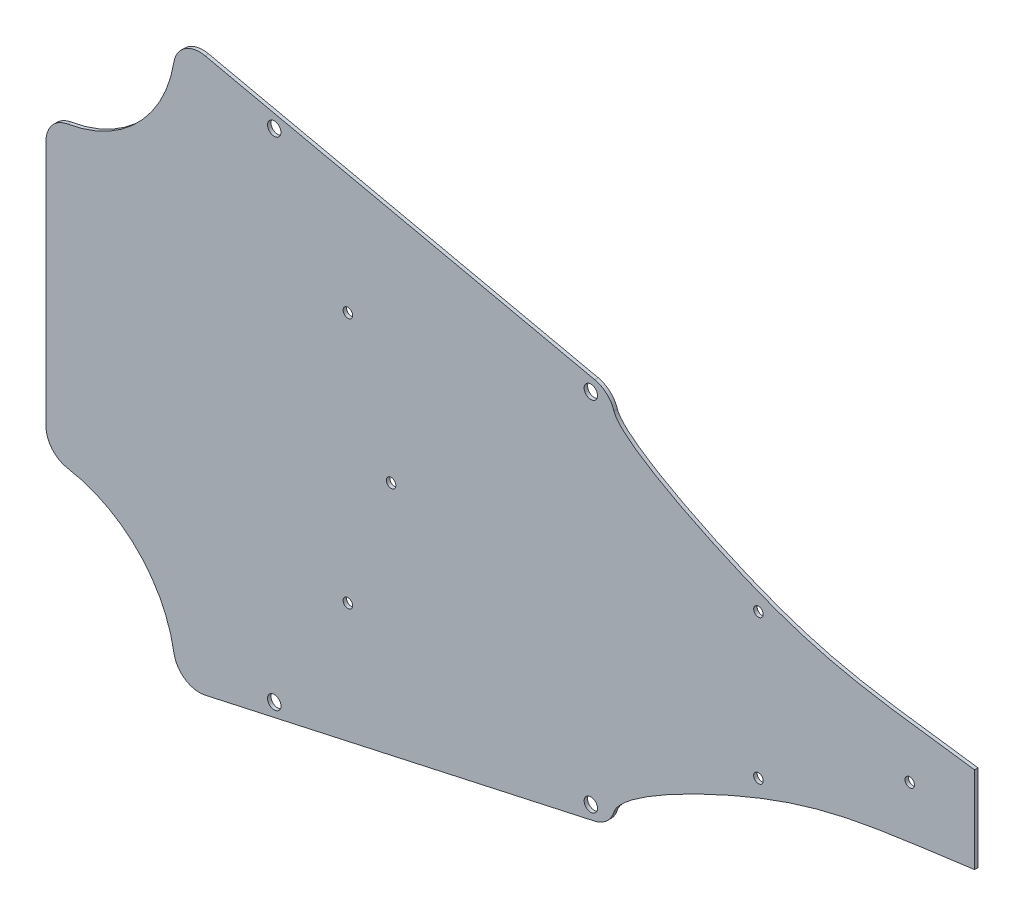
from build123d import *

# Parameters (mm, degrees)
ESQUISSE1_R      = 1.55
ESQUISSE1_R_2    = 1.1
ESQUISSE1_R_3    = 1.549999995
EXTRUSION1_DEPTH = 0.8


with BuildPart() as part:
    # Esquisse1 → Extrusion1 (new body)
    with BuildSketch(Plane.XY):
        with BuildLine():
            Line((25.150523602, 28.5698389), (25.150523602, -28.5698389))
            ThreePointArc((25.150523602, -28.5698389), (26.567947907, -32.442822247), (30.150523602, -34.485918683))
            ThreePointArc((30.150523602, -34.485918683), (46.403818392, -42.893281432), (54.749627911, -59.178268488))
            ThreePointArc((54.749627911, -59.178268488), (57.304746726, -63.16843283), (61.958135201, -64.060631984))
            Line((61.958135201, -64.060631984), (152.131314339, -44.230345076))
            ThreePointArc((152.131314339, -44.230345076), (154.881503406, -42.807429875), (156.555979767, -40.202750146))
            add(Edge.make_bspline(
                [(240, -10), (216.274031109, -13.229517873), (198.784165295, -14.481909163), (158.014867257, -35.653942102), (156.555979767, -40.202750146)],
                knots=[0, 0, 0, 0, 0.573688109, 0.920874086, 0.920874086, 0.920874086, 0.920874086], degree=3))
            Line((240, -10), (240, 10))
            add(Edge.make_bspline(
                [(240, 10), (216.274031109, 13.229517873), (198.784165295, 14.481909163), (158.014867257, 35.653942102), (156.555979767, 40.202750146)],
                knots=[0, 0, 0, 0, 0.573688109, 0.920874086, 0.920874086, 0.920874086, 0.920874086], degree=3))
            ThreePointArc((156.555979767, 40.202750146), (154.881503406, 42.807429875), (152.131314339, 44.230345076))
            Line((152.131314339, 44.230345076), (61.958135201, 64.060631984))
            ThreePointArc((61.958135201, 64.060631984), (57.304746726, 63.16843283), (54.749627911, 59.178268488))
            ThreePointArc((54.749627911, 59.178268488), (46.403818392, 42.893281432), (30.150523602, 34.485918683))
            ThreePointArc((30.150523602, 34.485918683), (26.567947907, 32.442822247), (25.150523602, 28.5698389))
        make_face()
        with Locations((151.214241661, 41.36033527)):
            Circle(ESQUISSE1_R, mode=Mode.SUBTRACT)
        with Locations(Location((151.214241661, -41.36033527, 0), (0, 0, 180))):
            Circle(ESQUISSE1_R, mode=Mode.SUBTRACT)
        with Locations((225, 0)):
            Circle(ESQUISSE1_R_2, mode=Mode.SUBTRACT)
        with Locations((105, 0)):
            Circle(ESQUISSE1_R_2, mode=Mode.SUBTRACT)
        with Locations((190, 16.683070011)):
            Circle(ESQUISSE1_R_2, mode=Mode.SUBTRACT)
        with Locations((95, 29.078947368)):
            Circle(ESQUISSE1_R_2, mode=Mode.SUBTRACT)
        with Locations(Location((190, -16.683070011, 0), (0, 0, 180))):
            Circle(ESQUISSE1_R_2, mode=Mode.SUBTRACT)
        with Locations(Location((95, -29.078947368, 0), (0, 0, 180))):
            Circle(ESQUISSE1_R_2, mode=Mode.SUBTRACT)
        with Locations(Location((77.964575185, -57.468915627, 0), (0, 0, 180))):
            Circle(ESQUISSE1_R_3, mode=Mode.SUBTRACT)
        with Locations((77.964575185, 57.468915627)):
            Circle(ESQUISSE1_R_3, mode=Mode.SUBTRACT)
    extrude(amount=EXTRUSION1_DEPTH)


solid = part.part
